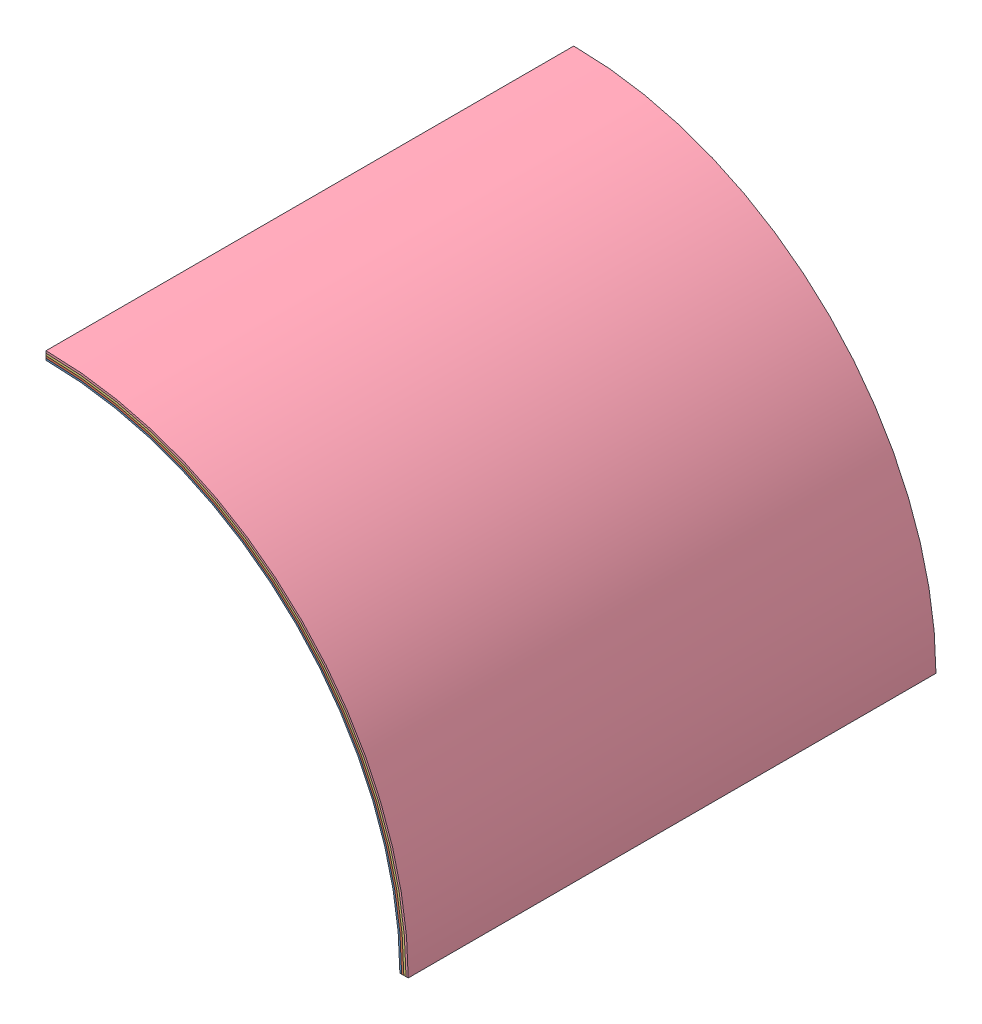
SolidWorks assembly NASA RASC-AL MLI and Inner Wall PRTYv3.SLDASM, configuration Default (file format 13000). Lengths in mm.
Overall size (2059 2059 3000).
4 component instances, 4 part files, 9 mates.
Components (placement in the parent):
- NASA RASC-AL Internal Wall PRTYv2-1: NASA RASC-AL Internal Wall PRTYv2.SLDPRT [Default] at (-319.7091 782.2821 3594.5266) size (2021.5 2021.5 3000)
- NASA RASC-AL MLI Layer 1 PRTYv3-1: NASA RASC-AL MLI Layer 1 PRTYv3.SLDPRT [Default] at (-319.7091 782.2821 3594.5266) size (2034 2034 3000)
- NASA RASC-AL MLI Layer 2 PRTYv3-1: NASA RASC-AL MLI Layer 2 PRTYv3.SLDPRT [Default] at (-319.7091 782.2821 3594.5266) size (2046.5 2046.5 3000)
- NASA RASC-AL MLI Layer 3 PRTYv3-1: NASA RASC-AL MLI Layer 3 PRTYv3.SLDPRT [Default] at (-319.7091 782.2821 3594.5266) size (2059 2059 3000)
Mates (geometry in assembly coordinates):
- Concentric1: concentric aligned: cylinder of NASA RASC-AL Internal Wall PRTYv2-1 through (-319.7091 782.2821 594.5266) axis (0 0 1) radius 2021.5; cylinder of NASA RASC-AL MLI Layer 1 PRTYv3-1 through (-319.7091 782.2821 594.5266) axis (0 0 1) radius 2021.5
- Coincident1: coincident aligned: plane of NASA RASC-AL Internal Wall PRTYv2-1 through (-319.7091 782.2821 3594.5266) normal (0 0 1); plane of NASA RASC-AL MLI Layer 1 PRTYv3-1 through (-319.7091 782.2821 3594.5266) normal (0 0 1)
- Coincident2: coincident aligned: plane of NASA RASC-AL Internal Wall PRTYv2-1 through (-319.7091 2803.7821 594.5266) normal (-1 0 0); plane of NASA RASC-AL MLI Layer 1 PRTYv3-1 through (-319.7091 2816.2821 594.5266) normal (-1 0 0)
- Concentric2: concentric aligned: cylinder of NASA RASC-AL MLI Layer 1 PRTYv3-1 through (-319.7091 782.2821 594.5266) axis (0 0 1) radius 2034; cylinder of NASA RASC-AL MLI Layer 2 PRTYv3-1 through (-319.7091 782.2821 594.5266) axis (0 0 1) radius 2034
- Coincident3: coincident aligned: plane of NASA RASC-AL MLI Layer 1 PRTYv3-1 through (-319.7091 782.2821 3594.5266) normal (0 0 1); plane of NASA RASC-AL MLI Layer 2 PRTYv3-1 through (-319.7091 782.2821 3594.5266) normal (0 0 1)
- Coincident4: coincident aligned: plane of NASA RASC-AL MLI Layer 1 PRTYv3-1 through (-319.7091 2816.2821 594.5266) normal (-1 0 0); plane of NASA RASC-AL MLI Layer 2 PRTYv3-1 through (-319.7091 2828.7821 594.5266) normal (-1 0 0)
- Concentric3: concentric aligned: cylinder of NASA RASC-AL MLI Layer 2 PRTYv3-1 through (-319.7091 782.2821 594.5266) axis (0 0 1) radius 2046.5; cylinder of NASA RASC-AL MLI Layer 3 PRTYv3-1 through (-319.7091 782.2821 594.5266) axis (0 0 1) radius 2046.5
- Coincident5: coincident aligned: plane of NASA RASC-AL MLI Layer 2 PRTYv3-1 through (-319.7091 782.2821 3594.5266) normal (0 0 1); plane of NASA RASC-AL MLI Layer 3 PRTYv3-1 through (-319.7091 782.2821 3594.5266) normal (0 0 1)
- Coincident6: coincident aligned: plane of NASA RASC-AL MLI Layer 2 PRTYv3-1 through (-319.7091 2828.7821 594.5266) normal (-1 0 0); plane of NASA RASC-AL MLI Layer 3 PRTYv3-1 through (-319.7091 2841.2821 594.5266) normal (-1 0 0)
